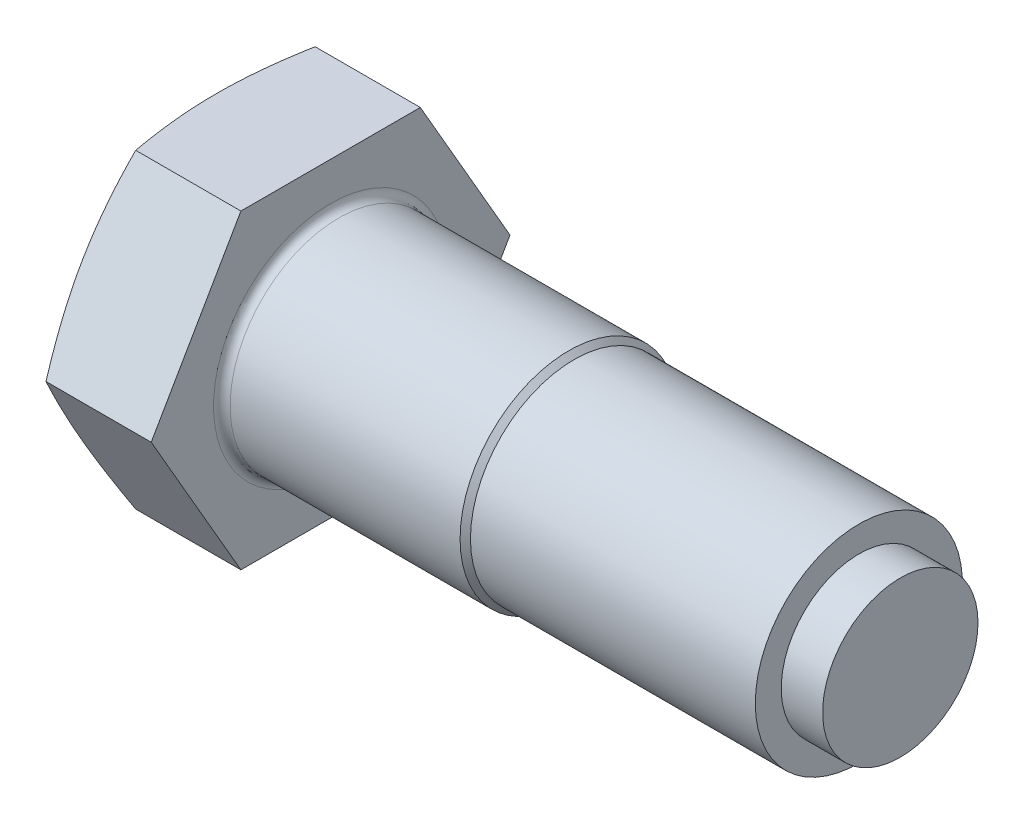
ISO-10303-21;
HEADER;
FILE_DESCRIPTION(('STEP AP214'),'2;1');
FILE_NAME('part.step','',(''),(''),'','','');
FILE_SCHEMA(('AUTOMOTIVE_DESIGN { 1 0 10303 214 1 1 1 1 }'));
ENDSEC;
DATA;
#1=APPLICATION_CONTEXT('core data for automotive mechanical design processes');
#2=APPLICATION_PROTOCOL_DEFINITION('international standard','automotive_design',2000,#1);
#3=PRODUCT_CONTEXT('',#1,'mechanical');
#4=PRODUCT('Part','Part','',(#3));
#5=PRODUCT_RELATED_PRODUCT_CATEGORY('part','',(#4));
#6=PRODUCT_DEFINITION_FORMATION('','',#4);
#7=PRODUCT_DEFINITION_CONTEXT('part definition',#1,'design');
#8=PRODUCT_DEFINITION('design','',#6,#7);
#9=PRODUCT_DEFINITION_SHAPE('','',#8);
#10=(LENGTH_UNIT() NAMED_UNIT(*) SI_UNIT(.MILLI.,.METRE.));
#11=(NAMED_UNIT(*) PLANE_ANGLE_UNIT() SI_UNIT($,.RADIAN.));
#12=(NAMED_UNIT(*) SI_UNIT($,.STERADIAN.) SOLID_ANGLE_UNIT());
#13=UNCERTAINTY_MEASURE_WITH_UNIT(LENGTH_MEASURE(1.E-05),#10,'distance_accuracy_value','');
#14=(GEOMETRIC_REPRESENTATION_CONTEXT(3) GLOBAL_UNCERTAINTY_ASSIGNED_CONTEXT((#13)) GLOBAL_UNIT_ASSIGNED_CONTEXT((#10,
#11,#12)) REPRESENTATION_CONTEXT('',''));
#15=CARTESIAN_POINT('',(0.,0.,0.));
#16=DIRECTION('',(0.,0.,1.));
#17=DIRECTION('',(1.,0.,0.));
#18=AXIS2_PLACEMENT_3D('',#15,#16,#17);
#19=CARTESIAN_POINT('',(11.,-15.,-8.66025403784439));
#20=DIRECTION('',(0.,0.5,0.866025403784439));
#21=DIRECTION('',(0.,-0.866025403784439,0.5));
#22=AXIS2_PLACEMENT_3D('',#19,#20,#21);
#23=PLANE('',#22);
#24=CARTESIAN_POINT('',(0.844637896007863,0.000200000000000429,-17.3206235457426));
#25=CARTESIAN_POINT('',(0.779364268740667,-0.310443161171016,-17.1412736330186));
#26=CARTESIAN_POINT('',(0.717026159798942,-0.621542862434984,-16.961660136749));
#27=CARTESIAN_POINT('',(0.598866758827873,-1.24469773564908,-16.6018815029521));
#28=CARTESIAN_POINT('',(0.543046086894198,-1.55675299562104,-16.4217163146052));
#29=CARTESIAN_POINT('',(0.386274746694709,-2.49475901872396,-15.8801582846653));
#30=CARTESIAN_POINT('',(0.296106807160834,-3.12212058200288,-15.5179509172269));
#31=CARTESIAN_POINT('',(0.186523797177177,-4.06237563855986,-14.9750944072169));
#32=CARTESIAN_POINT('',(0.154367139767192,-4.37418429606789,-14.7950715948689));
#33=CARTESIAN_POINT('',(0.0988350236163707,-4.99838379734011,-14.4346898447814));
#34=CARTESIAN_POINT('',(0.075459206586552,-5.31077461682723,-14.2543309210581));
#35=CARTESIAN_POINT('',(0.0378970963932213,-5.93586386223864,-13.8934354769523));
#36=CARTESIAN_POINT('',(0.0237076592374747,-6.24856214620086,-13.7128990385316));
#37=CARTESIAN_POINT('',(0.00475912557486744,-6.87417362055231,-13.3517020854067));
#38=CARTESIAN_POINT('',(0.,-7.18708681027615,-13.1710415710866));
#39=CARTESIAN_POINT('',(0.,-7.81291318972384,-12.8097205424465));
#40=CARTESIAN_POINT('',(0.00475912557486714,-8.12582637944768,-12.6290600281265));
#41=CARTESIAN_POINT('',(0.0237076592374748,-8.75143785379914,-12.2678630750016));
#42=CARTESIAN_POINT('',(0.0378970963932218,-9.06413613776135,-12.0873266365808));
#43=CARTESIAN_POINT('',(0.0754592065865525,-9.68922538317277,-11.726431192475));
#44=CARTESIAN_POINT('',(0.0988350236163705,-10.0016162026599,-11.5460722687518));
#45=CARTESIAN_POINT('',(0.154367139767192,-10.6258157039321,-11.1856905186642));
#46=CARTESIAN_POINT('',(0.186523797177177,-10.9376243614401,-11.0056677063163));
#47=CARTESIAN_POINT('',(0.296106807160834,-11.8778794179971,-10.4628111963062));
#48=CARTESIAN_POINT('',(0.386274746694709,-12.505240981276,-10.1006038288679));
#49=CARTESIAN_POINT('',(0.543046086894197,-13.443247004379,-9.55904579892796));
#50=CARTESIAN_POINT('',(0.598866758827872,-13.7553022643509,-9.37888061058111));
#51=CARTESIAN_POINT('',(0.71702615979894,-14.378457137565,-9.01910197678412));
#52=CARTESIAN_POINT('',(0.779364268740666,-14.689556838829,-8.83948848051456));
#53=CARTESIAN_POINT('',(0.844637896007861,-15.0002,-8.66013856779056));
#54=B_SPLINE_CURVE_WITH_KNOTS('',3,(#24,#25,#26,#27,#28,#29,#30,#31,#32,#33,#34,#35,#36,#37,#38,
#39,#40,#41,#42,#43,#44,#45,#46,#47,#48,#49,#50,#51,#52,#53),.UNSPECIFIED.,.F.,.F.,(4,2,2,2,2,2,
2,2,2,2,2,2,2,2,4),(0.,1.0937389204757,2.18758181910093,4.37677976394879,5.46113055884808,
6.54543710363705,7.62937235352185,8.71330426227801,9.79723617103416,10.881171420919,
11.9654779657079,13.0498287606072,15.2390267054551,16.3328696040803,17.426608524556),.UNSPECIFIED.);
#55=CARTESIAN_POINT('',(0.844595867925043,0.,-17.3205080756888));
#56=VERTEX_POINT('',#55);
#57=CARTESIAN_POINT('',(0.,-7.5,-12.9903810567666));
#58=VERTEX_POINT('',#57);
#59=EDGE_CURVE('E113',#56,#58,#54,.T.);
#60=ORIENTED_EDGE('',*,*,#59,.F.);
#61=DIRECTION('',(-1.,0.,0.));
#62=VECTOR('',#61,1.);
#63=CARTESIAN_POINT('',(11.,0.,-17.3205080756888));
#64=LINE('',#63,#62);
#65=CARTESIAN_POINT('',(11.,0.,-17.3205080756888));
#66=VERTEX_POINT('',#65);
#67=EDGE_CURVE('E142',#66,#56,#64,.T.);
#68=ORIENTED_EDGE('',*,*,#67,.F.);
#69=DIRECTION('',(0.,0.866025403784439,-0.5));
#70=VECTOR('',#69,1.);
#71=CARTESIAN_POINT('',(11.,-15.,-8.66025403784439));
#72=LINE('',#71,#70);
#73=CARTESIAN_POINT('',(11.,-15.,-8.66025403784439));
#74=VERTEX_POINT('',#73);
#75=EDGE_CURVE('E179',#74,#66,#72,.T.);
#76=ORIENTED_EDGE('',*,*,#75,.F.);
#77=DIRECTION('',(-1.,0.,0.));
#78=VECTOR('',#77,1.);
#79=CARTESIAN_POINT('',(11.,-15.,-8.66025403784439));
#80=LINE('',#79,#78);
#81=CARTESIAN_POINT('',(0.844595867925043,-15.,-8.66025403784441));
#82=VERTEX_POINT('',#81);
#83=EDGE_CURVE('E136',#74,#82,#80,.T.);
#84=ORIENTED_EDGE('',*,*,#83,.T.);
#85=EDGE_CURVE('E200',#58,#82,#54,.T.);
#86=ORIENTED_EDGE('',*,*,#85,.F.);
#87=EDGE_LOOP('',(#60,#68,#76,#84,#86));
#88=FACE_BOUND('',#87,.T.);
#89=ADVANCED_FACE('F35',(#88),#23,.F.);
#90=CARTESIAN_POINT('',(11.,0.,-17.3205080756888));
#91=DIRECTION('',(0.,-0.5,0.866025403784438));
#92=DIRECTION('',(0.,-0.866025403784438,-0.5));
#93=AXIS2_PLACEMENT_3D('',#90,#91,#92);
#94=PLANE('',#93);
#95=CARTESIAN_POINT('',(0.844637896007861,15.0002,-8.66013856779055));
#96=CARTESIAN_POINT('',(0.779364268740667,14.689556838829,-8.83948848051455));
#97=CARTESIAN_POINT('',(0.717026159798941,14.378457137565,-9.01910197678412));
#98=CARTESIAN_POINT('',(0.598866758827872,13.7553022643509,-9.37888061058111));
#99=CARTESIAN_POINT('',(0.543046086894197,13.443247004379,-9.55904579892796));
#100=CARTESIAN_POINT('',(0.386274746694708,12.505240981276,-10.1006038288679));
#101=CARTESIAN_POINT('',(0.296106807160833,11.8778794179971,-10.4628111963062));
#102=CARTESIAN_POINT('',(0.186523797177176,10.9376243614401,-11.0056677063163));
#103=CARTESIAN_POINT('',(0.154367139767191,10.6258157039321,-11.1856905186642));
#104=CARTESIAN_POINT('',(0.0988350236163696,10.0016162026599,-11.5460722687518));
#105=CARTESIAN_POINT('',(0.0754592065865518,9.68922538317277,-11.726431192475));
#106=CARTESIAN_POINT('',(0.0378970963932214,9.06413613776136,-12.0873266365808));
#107=CARTESIAN_POINT('',(0.0237076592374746,8.75143785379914,-12.2678630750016));
#108=CARTESIAN_POINT('',(0.00475912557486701,8.12582637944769,-12.6290600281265));
#109=CARTESIAN_POINT('',(0.,7.81291318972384,-12.8097205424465));
#110=CARTESIAN_POINT('',(0.,7.18708681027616,-13.1710415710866));
#111=CARTESIAN_POINT('',(0.00475912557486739,6.87417362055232,-13.3517020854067));
#112=CARTESIAN_POINT('',(0.0237076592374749,6.24856214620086,-13.7128990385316));
#113=CARTESIAN_POINT('',(0.0378970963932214,5.93586386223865,-13.8934354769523));
#114=CARTESIAN_POINT('',(0.0754592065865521,5.31077461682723,-14.2543309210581));
#115=CARTESIAN_POINT('',(0.0988350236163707,4.99838379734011,-14.4346898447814));
#116=CARTESIAN_POINT('',(0.154367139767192,4.37418429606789,-14.7950715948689));
#117=CARTESIAN_POINT('',(0.186523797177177,4.06237563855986,-14.9750944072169));
#118=CARTESIAN_POINT('',(0.296106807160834,3.12212058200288,-15.5179509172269));
#119=CARTESIAN_POINT('',(0.386274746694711,2.49475901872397,-15.8801582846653));
#120=CARTESIAN_POINT('',(0.543046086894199,1.55675299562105,-16.4217163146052));
#121=CARTESIAN_POINT('',(0.598866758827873,1.24469773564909,-16.6018815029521));
#122=CARTESIAN_POINT('',(0.717026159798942,0.621542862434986,-16.961660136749));
#123=CARTESIAN_POINT('',(0.779364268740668,0.310443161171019,-17.1412736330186));
#124=CARTESIAN_POINT('',(0.844637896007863,-0.000199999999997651,-17.3206235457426));
#125=B_SPLINE_CURVE_WITH_KNOTS('',3,(#95,#96,#97,#98,#99,#100,#101,#102,#103,#104,#105,#106,
#107,#108,#109,#110,#111,#112,#113,#114,#115,#116,#117,#118,#119,#120,#121,#122,#123,#124),
.UNSPECIFIED.,.F.,.F.,(4,2,2,2,2,2,2,2,2,2,2,2,2,2,4),(0.,1.0937389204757,2.18758181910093,
4.37677976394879,5.46113055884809,6.54543710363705,7.62937235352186,8.71330426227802,
9.79723617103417,10.881171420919,11.9654779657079,13.0498287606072,15.2390267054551,
16.3328696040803,17.426608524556),.UNSPECIFIED.);
#126=CARTESIAN_POINT('',(0.844595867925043,15.,-8.6602540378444));
#127=VERTEX_POINT('',#126);
#128=CARTESIAN_POINT('',(0.,7.50000000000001,-12.9903810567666));
#129=VERTEX_POINT('',#128);
#130=EDGE_CURVE('E252',#127,#129,#125,.T.);
#131=ORIENTED_EDGE('',*,*,#130,.F.);
#132=DIRECTION('',(-1.,0.,0.));
#133=VECTOR('',#132,1.);
#134=CARTESIAN_POINT('',(11.,15.,-8.66025403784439));
#135=LINE('',#134,#133);
#136=CARTESIAN_POINT('',(11.,15.,-8.66025403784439));
#137=VERTEX_POINT('',#136);
#138=EDGE_CURVE('E133',#137,#127,#135,.T.);
#139=ORIENTED_EDGE('',*,*,#138,.F.);
#140=DIRECTION('',(0.,0.866025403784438,0.5));
#141=VECTOR('',#140,1.);
#142=CARTESIAN_POINT('',(11.,0.,-17.3205080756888));
#143=LINE('',#142,#141);
#144=EDGE_CURVE('E182',#66,#137,#143,.T.);
#145=ORIENTED_EDGE('',*,*,#144,.F.);
#146=ORIENTED_EDGE('',*,*,#67,.T.);
#147=EDGE_CURVE('E125',#129,#56,#125,.T.);
#148=ORIENTED_EDGE('',*,*,#147,.F.);
#149=EDGE_LOOP('',(#131,#139,#145,#146,#148));
#150=FACE_BOUND('',#149,.T.);
#151=ADVANCED_FACE('F258',(#150),#94,.F.);
#152=CARTESIAN_POINT('',(11.,15.,-8.66025403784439));
#153=DIRECTION('',(0.,-1.,0.));
#154=DIRECTION('',(0.,0.,-1.));
#155=AXIS2_PLACEMENT_3D('',#152,#153,#154);
#156=PLANE('',#155);
#157=CARTESIAN_POINT('',(4.5131853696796,15.,-22.9293075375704));
#158=CARTESIAN_POINT('',(4.40983513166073,15.,-22.5899853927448));
#159=CARTESIAN_POINT('',(4.30710990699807,15.,-22.2504729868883));
#160=CARTESIAN_POINT('',(4.10304940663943,15.,-21.5710286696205));
#161=CARTESIAN_POINT('',(4.0017141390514,15.,-21.2310967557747));
#162=CARTESIAN_POINT('',(3.69999008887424,15.,-20.2105689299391));
#163=CARTESIAN_POINT('',(3.50189837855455,15.,-19.5292910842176));
#164=CARTESIAN_POINT('',(3.11288892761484,15.,-18.163310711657));
#165=CARTESIAN_POINT('',(2.92198526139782,15.,-17.4786041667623));
#166=CARTESIAN_POINT('',(2.54957050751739,15.,-16.1066443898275));
#167=CARTESIAN_POINT('',(2.36805925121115,15.,-15.4193912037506));
#168=CARTESIAN_POINT('',(2.0189263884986,15.,-14.0503721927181));
#169=CARTESIAN_POINT('',(1.851161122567,15.,-13.368643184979));
#170=CARTESIAN_POINT('',(1.52991356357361,15.,-12.0017928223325));
#171=CARTESIAN_POINT('',(1.37643151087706,15.,-11.3166714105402));
#172=CARTESIAN_POINT('',(1.08732897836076,15.,-9.94288290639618));
#173=CARTESIAN_POINT('',(0.951702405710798,15.,-9.25421710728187));
#174=CARTESIAN_POINT('',(0.702440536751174,15.,-7.8728873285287));
#175=CARTESIAN_POINT('',(0.588804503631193,15.,-7.18022348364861));
#176=CARTESIAN_POINT('',(0.399391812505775,15.,-5.86889428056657));
#177=CARTESIAN_POINT('',(0.32079887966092,15.,-5.25063953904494));
#178=CARTESIAN_POINT('',(0.187759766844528,15.,-4.01151576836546));
#179=CARTESIAN_POINT('',(0.133312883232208,15.,-3.39064681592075));
#180=CARTESIAN_POINT('',(0.0511879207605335,15.,-2.14755397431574));
#181=CARTESIAN_POINT('',(0.0234909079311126,15.,-1.52533135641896));
#182=CARTESIAN_POINT('',(-0.00373201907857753,15.,-0.280263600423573));
#183=CARTESIAN_POINT('',(-0.00325813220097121,15.,0.342581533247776));
#184=CARTESIAN_POINT('',(0.02590876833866,15.,1.59076022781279));
#185=CARTESIAN_POINT('',(0.0547448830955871,15.,2.21609038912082));
#186=CARTESIAN_POINT('',(0.139309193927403,15.,3.46491396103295));
#187=CARTESIAN_POINT('',(0.195038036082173,15.,4.08840732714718));
#188=CARTESIAN_POINT('',(0.330780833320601,15.,5.33324943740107));
#189=CARTESIAN_POINT('',(0.41081564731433,15.,5.9545958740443));
#190=CARTESIAN_POINT('',(0.591923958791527,15.,7.19418030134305));
#191=CARTESIAN_POINT('',(0.692997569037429,15.,7.81241827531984));
#192=CARTESIAN_POINT('',(0.918710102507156,15.,9.07831857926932));
#193=CARTESIAN_POINT('',(1.04431272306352,15.,9.72580754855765));
#194=CARTESIAN_POINT('',(1.3116837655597,15.,11.0174604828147));
#195=CARTESIAN_POINT('',(1.45345340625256,15.,11.6616241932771));
#196=CARTESIAN_POINT('',(1.75018161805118,15.,12.9470856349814));
#197=CARTESIAN_POINT('',(1.90514401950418,15.,13.5883824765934));
#198=CARTESIAN_POINT('',(2.22573697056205,15.,14.8682746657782));
#199=CARTESIAN_POINT('',(2.39136726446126,15.,15.5068700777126));
#200=CARTESIAN_POINT('',(2.73152020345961,15.,16.7825582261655));
#201=CARTESIAN_POINT('',(2.90605399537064,15.,17.419647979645));
#202=CARTESIAN_POINT('',(3.26222144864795,15.,18.6918370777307));
#203=CARTESIAN_POINT('',(3.4438551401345,15.,19.3269364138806));
#204=CARTESIAN_POINT('',(3.81292279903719,15.,20.5953282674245));
#205=CARTESIAN_POINT('',(4.00035578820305,15.,21.2286210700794));
#206=CARTESIAN_POINT('',(4.38004374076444,15.,22.4937555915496));
#207=CARTESIAN_POINT('',(4.57229869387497,15.,23.1255973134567));
#208=CARTESIAN_POINT('',(4.95868121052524,15.,24.3810727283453));
#209=CARTESIAN_POINT('',(5.1527646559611,15.,25.0047200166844));
#210=CARTESIAN_POINT('',(5.54424157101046,15.,26.2509755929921));
#211=CARTESIAN_POINT('',(5.74163505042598,15.,26.8735838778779));
#212=CARTESIAN_POINT('',(6.33801421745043,15.,28.74012618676));
#213=CARTESIAN_POINT('',(6.74118201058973,15.,29.9827239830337));
#214=CARTESIAN_POINT('',(7.55410304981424,15.,32.4605337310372));
#215=CARTESIAN_POINT('',(7.96382550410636,15.,33.6957558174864));
#216=CARTESIAN_POINT('',(8.58295834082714,15.,35.5470094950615));
#217=CARTESIAN_POINT('',(8.79008571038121,15.,36.1638059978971));
#218=CARTESIAN_POINT('',(9.20568070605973,15.,37.3969457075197));
#219=CARTESIAN_POINT('',(9.41414832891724,15.,38.0132889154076));
#220=CARTESIAN_POINT('',(9.62319587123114,15.,38.6294352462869));
#221=B_SPLINE_CURVE_WITH_KNOTS('',3,(#157,#158,#159,#160,#161,#162,#163,#164,#165,#166,#167,
#168,#169,#170,#171,#172,#173,#174,#175,#176,#177,#178,#179,#180,#181,#182,#183,#184,#185,#186,
#187,#188,#189,#190,#191,#192,#193,#194,#195,#196,#197,#198,#199,#200,#201,#202,#203,#204,#205,
#206,#207,#208,#209,#210,#211,#212,#213,#214,#215,#216,#217,#218,#219,#220),.UNSPECIFIED.,.F.,
.F.,(4,2,2,2,2,2,2,2,2,2,2,2,2,2,2,2,2,2,2,2,2,2,2,2,2,2,2,2,2,2,2,4),(0.,1.06413565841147,
2.12827752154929,4.25671855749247,6.38913073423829,8.52150460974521,10.6275874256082,
12.7337056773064,14.8391033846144,16.9444305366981,18.81371040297,20.6829357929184,
22.5508371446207,24.4187253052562,26.2960864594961,28.1734927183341,30.052514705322,
31.9315467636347,33.9099705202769,35.888543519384,37.8676929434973,39.8467949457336,
41.8284386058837,43.8100906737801,45.7914102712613,47.7727256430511,49.732163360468,
51.6916068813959,55.6106625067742,59.5148479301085,61.4667833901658,63.4187140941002),.UNSPECIFIED.);
#222=CARTESIAN_POINT('',(0.844595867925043,15.,8.66025403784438));
#223=VERTEX_POINT('',#222);
#224=CARTESIAN_POINT('',(0.,15.,0.));
#225=VERTEX_POINT('',#224);
#226=EDGE_CURVE('E50',#223,#225,#221,.F.);
#227=ORIENTED_EDGE('',*,*,#226,.F.);
#228=DIRECTION('',(-1.,0.,0.));
#229=VECTOR('',#228,1.);
#230=CARTESIAN_POINT('',(11.,15.,8.66025403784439));
#231=LINE('',#230,#229);
#232=CARTESIAN_POINT('',(11.,15.,8.66025403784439));
#233=VERTEX_POINT('',#232);
#234=EDGE_CURVE('E130',#233,#223,#231,.T.);
#235=ORIENTED_EDGE('',*,*,#234,.F.);
#236=DIRECTION('',(0.,0.,1.));
#237=VECTOR('',#236,1.);
#238=CARTESIAN_POINT('',(11.,15.,-8.66025403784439));
#239=LINE('',#238,#237);
#240=EDGE_CURVE('E188',#137,#233,#239,.T.);
#241=ORIENTED_EDGE('',*,*,#240,.F.);
#242=ORIENTED_EDGE('',*,*,#138,.T.);
#243=EDGE_CURVE('E253',#225,#127,#221,.F.);
#244=ORIENTED_EDGE('',*,*,#243,.F.);
#245=EDGE_LOOP('',(#227,#235,#241,#242,#244));
#246=FACE_BOUND('',#245,.T.);
#247=ADVANCED_FACE('F261',(#246),#156,.F.);
#248=CARTESIAN_POINT('',(11.,15.,8.66025403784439));
#249=DIRECTION('',(0.,-0.5,-0.866025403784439));
#250=DIRECTION('',(0.,0.866025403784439,-0.5));
#251=AXIS2_PLACEMENT_3D('',#248,#249,#250);
#252=PLANE('',#251);
#253=CARTESIAN_POINT('',(0.844637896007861,-0.000199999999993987,17.3206235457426));
#254=CARTESIAN_POINT('',(0.779364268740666,0.310443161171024,17.1412736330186));
#255=CARTESIAN_POINT('',(0.71702615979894,0.621542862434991,16.961660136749));
#256=CARTESIAN_POINT('',(0.598866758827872,1.24469773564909,16.6018815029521));
#257=CARTESIAN_POINT('',(0.543046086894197,1.55675299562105,16.4217163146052));
#258=CARTESIAN_POINT('',(0.386274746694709,2.49475901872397,15.8801582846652));
#259=CARTESIAN_POINT('',(0.296106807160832,3.12212058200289,15.5179509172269));
#260=CARTESIAN_POINT('',(0.186523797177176,4.06237563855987,14.9750944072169));
#261=CARTESIAN_POINT('',(0.154367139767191,4.3741842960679,14.7950715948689));
#262=CARTESIAN_POINT('',(0.0988350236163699,4.99838379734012,14.4346898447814));
#263=CARTESIAN_POINT('',(0.0754592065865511,5.31077461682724,14.2543309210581));
#264=CARTESIAN_POINT('',(0.0378970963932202,5.93586386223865,13.8934354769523));
#265=CARTESIAN_POINT('',(0.0237076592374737,6.24856214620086,13.7128990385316));
#266=CARTESIAN_POINT('',(0.00475912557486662,6.87417362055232,13.3517020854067));
#267=CARTESIAN_POINT('',(0.,7.18708681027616,13.1710415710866));
#268=CARTESIAN_POINT('',(0.,7.81291318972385,12.8097205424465));
#269=CARTESIAN_POINT('',(0.00475912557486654,8.12582637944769,12.6290600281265));
#270=CARTESIAN_POINT('',(0.0237076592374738,8.75143785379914,12.2678630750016));
#271=CARTESIAN_POINT('',(0.0378970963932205,9.06413613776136,12.0873266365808));
#272=CARTESIAN_POINT('',(0.0754592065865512,9.68922538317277,11.726431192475));
#273=CARTESIAN_POINT('',(0.0988350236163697,10.0016162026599,11.5460722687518));
#274=CARTESIAN_POINT('',(0.154367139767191,10.6258157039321,11.1856905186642));
#275=CARTESIAN_POINT('',(0.186523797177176,10.9376243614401,11.0056677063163));
#276=CARTESIAN_POINT('',(0.296106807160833,11.8778794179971,10.4628111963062));
#277=CARTESIAN_POINT('',(0.386274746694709,12.505240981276,10.1006038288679));
#278=CARTESIAN_POINT('',(0.543046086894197,13.443247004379,9.55904579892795));
#279=CARTESIAN_POINT('',(0.598866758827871,13.7553022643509,9.3788806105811));
#280=CARTESIAN_POINT('',(0.71702615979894,14.378457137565,9.01910197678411));
#281=CARTESIAN_POINT('',(0.779364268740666,14.689556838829,8.83948848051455));
#282=CARTESIAN_POINT('',(0.844637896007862,15.0002,8.66013856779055));
#283=B_SPLINE_CURVE_WITH_KNOTS('',3,(#253,#254,#255,#256,#257,#258,#259,#260,#261,#262,#263,
#264,#265,#266,#267,#268,#269,#270,#271,#272,#273,#274,#275,#276,#277,#278,#279,#280,#281,#282),
.UNSPECIFIED.,.F.,.F.,(4,2,2,2,2,2,2,2,2,2,2,2,2,2,4),(0.,1.0937389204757,2.18758181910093,
4.37677976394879,5.46113055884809,6.54543710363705,7.62937235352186,8.71330426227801,
9.79723617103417,10.881171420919,11.9654779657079,13.0498287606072,15.2390267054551,
16.3328696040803,17.426608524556),.UNSPECIFIED.);
#284=CARTESIAN_POINT('',(0.844595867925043,0.,17.3205080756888));
#285=VERTEX_POINT('',#284);
#286=CARTESIAN_POINT('',(0.,7.5,12.9903810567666));
#287=VERTEX_POINT('',#286);
#288=EDGE_CURVE('E58',#285,#287,#283,.T.);
#289=ORIENTED_EDGE('',*,*,#288,.F.);
#290=DIRECTION('',(-1.,0.,0.));
#291=VECTOR('',#290,1.);
#292=CARTESIAN_POINT('',(11.,0.,17.3205080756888));
#293=LINE('',#292,#291);
#294=CARTESIAN_POINT('',(11.,0.,17.3205080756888));
#295=VERTEX_POINT('',#294);
#296=EDGE_CURVE('E121',#295,#285,#293,.T.);
#297=ORIENTED_EDGE('',*,*,#296,.F.);
#298=DIRECTION('',(0.,-0.866025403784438,0.5));
#299=VECTOR('',#298,1.);
#300=CARTESIAN_POINT('',(11.,15.,8.66025403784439));
#301=LINE('',#300,#299);
#302=EDGE_CURVE('E190',#233,#295,#301,.T.);
#303=ORIENTED_EDGE('',*,*,#302,.F.);
#304=ORIENTED_EDGE('',*,*,#234,.T.);
#305=EDGE_CURVE('E124',#287,#223,#283,.T.);
#306=ORIENTED_EDGE('',*,*,#305,.F.);
#307=EDGE_LOOP('',(#289,#297,#303,#304,#306));
#308=FACE_BOUND('',#307,.T.);
#309=ADVANCED_FACE('F119',(#308),#252,.F.);
#310=CARTESIAN_POINT('',(11.,0.,17.3205080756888));
#311=DIRECTION('',(0.,0.5,-0.866025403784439));
#312=DIRECTION('',(0.,0.866025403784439,0.5));
#313=AXIS2_PLACEMENT_3D('',#310,#311,#312);
#314=PLANE('',#313);
#315=CARTESIAN_POINT('',(0.844637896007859,-15.0002,8.66013856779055));
#316=CARTESIAN_POINT('',(0.779364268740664,-14.689556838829,8.83948848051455));
#317=CARTESIAN_POINT('',(0.717026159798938,-14.378457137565,9.01910197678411));
#318=CARTESIAN_POINT('',(0.59886675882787,-13.7553022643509,9.3788806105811));
#319=CARTESIAN_POINT('',(0.543046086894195,-13.4432470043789,9.55904579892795));
#320=CARTESIAN_POINT('',(0.386274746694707,-12.505240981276,10.1006038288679));
#321=CARTESIAN_POINT('',(0.296106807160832,-11.8778794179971,10.4628111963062));
#322=CARTESIAN_POINT('',(0.186523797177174,-10.9376243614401,11.0056677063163));
#323=CARTESIAN_POINT('',(0.154367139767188,-10.6258157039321,11.1856905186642));
#324=CARTESIAN_POINT('',(0.098835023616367,-10.0016162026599,11.5460722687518));
#325=CARTESIAN_POINT('',(0.075459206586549,-9.68922538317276,11.726431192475));
#326=CARTESIAN_POINT('',(0.0378970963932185,-9.06413613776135,12.0873266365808));
#327=CARTESIAN_POINT('',(0.0237076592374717,-8.75143785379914,12.2678630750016));
#328=CARTESIAN_POINT('',(0.00475912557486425,-8.12582637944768,12.6290600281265));
#329=CARTESIAN_POINT('',(0.,-7.81291318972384,12.8097205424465));
#330=CARTESIAN_POINT('',(0.,-7.18708681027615,13.1710415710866));
#331=CARTESIAN_POINT('',(0.00475912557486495,-6.87417362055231,13.3517020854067));
#332=CARTESIAN_POINT('',(0.0237076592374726,-6.24856214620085,13.7128990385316));
#333=CARTESIAN_POINT('',(0.0378970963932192,-5.93586386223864,13.8934354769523));
#334=CARTESIAN_POINT('',(0.0754592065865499,-5.31077461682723,14.2543309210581));
#335=CARTESIAN_POINT('',(0.0988350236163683,-4.99838379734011,14.4346898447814));
#336=CARTESIAN_POINT('',(0.154367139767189,-4.37418429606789,14.7950715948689));
#337=CARTESIAN_POINT('',(0.186523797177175,-4.06237563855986,14.9750944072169));
#338=CARTESIAN_POINT('',(0.296106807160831,-3.12212058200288,15.5179509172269));
#339=CARTESIAN_POINT('',(0.386274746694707,-2.49475901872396,15.8801582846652));
#340=CARTESIAN_POINT('',(0.543046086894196,-1.55675299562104,16.4217163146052));
#341=CARTESIAN_POINT('',(0.598866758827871,-1.24469773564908,16.6018815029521));
#342=CARTESIAN_POINT('',(0.71702615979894,-0.62154286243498,16.961660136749));
#343=CARTESIAN_POINT('',(0.779364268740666,-0.310443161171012,17.1412736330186));
#344=CARTESIAN_POINT('',(0.844637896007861,0.000200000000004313,17.3206235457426));
#345=B_SPLINE_CURVE_WITH_KNOTS('',3,(#315,#316,#317,#318,#319,#320,#321,#322,#323,#324,#325,
#326,#327,#328,#329,#330,#331,#332,#333,#334,#335,#336,#337,#338,#339,#340,#341,#342,#343,#344),
.UNSPECIFIED.,.F.,.F.,(4,2,2,2,2,2,2,2,2,2,2,2,2,2,4),(0.,1.0937389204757,2.18758181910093,
4.37677976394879,5.46113055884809,6.54543710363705,7.62937235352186,8.71330426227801,
9.79723617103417,10.881171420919,11.9654779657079,13.0498287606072,15.2390267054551,
16.3328696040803,17.426608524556),.UNSPECIFIED.);
#346=CARTESIAN_POINT('',(0.844595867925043,-15.,8.66025403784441));
#347=VERTEX_POINT('',#346);
#348=CARTESIAN_POINT('',(0.,-7.5,12.9903810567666));
#349=VERTEX_POINT('',#348);
#350=EDGE_CURVE('E115',#347,#349,#345,.T.);
#351=ORIENTED_EDGE('',*,*,#350,.F.);
#352=DIRECTION('',(-1.,0.,0.));
#353=VECTOR('',#352,1.);
#354=CARTESIAN_POINT('',(11.,-15.,8.66025403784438));
#355=LINE('',#354,#353);
#356=CARTESIAN_POINT('',(11.,-15.,8.66025403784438));
#357=VERTEX_POINT('',#356);
#358=EDGE_CURVE('E131',#357,#347,#355,.T.);
#359=ORIENTED_EDGE('',*,*,#358,.F.);
#360=DIRECTION('',(0.,-0.866025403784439,-0.5));
#361=VECTOR('',#360,1.);
#362=CARTESIAN_POINT('',(11.,0.,17.3205080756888));
#363=LINE('',#362,#361);
#364=EDGE_CURVE('E129',#295,#357,#363,.T.);
#365=ORIENTED_EDGE('',*,*,#364,.F.);
#366=ORIENTED_EDGE('',*,*,#296,.T.);
#367=EDGE_CURVE('E105',#349,#285,#345,.T.);
#368=ORIENTED_EDGE('',*,*,#367,.F.);
#369=EDGE_LOOP('',(#351,#359,#365,#366,#368));
#370=FACE_BOUND('',#369,.T.);
#371=ADVANCED_FACE('F127',(#370),#314,.F.);
#372=CARTESIAN_POINT('',(11.,-15.,8.66025403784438));
#373=DIRECTION('',(0.,1.,0.));
#374=DIRECTION('',(0.,0.,1.));
#375=AXIS2_PLACEMENT_3D('',#372,#373,#374);
#376=PLANE('',#375);
#377=CARTESIAN_POINT('',(4.5131853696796,-15.,-22.9293075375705));
#378=CARTESIAN_POINT('',(4.40983513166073,-15.,-22.5899853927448));
#379=CARTESIAN_POINT('',(4.30710990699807,-15.,-22.2504729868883));
#380=CARTESIAN_POINT('',(4.10304940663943,-15.,-21.5710286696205));
#381=CARTESIAN_POINT('',(4.0017141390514,-15.,-21.2310967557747));
#382=CARTESIAN_POINT('',(3.69999008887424,-15.,-20.2105689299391));
#383=CARTESIAN_POINT('',(3.50189837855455,-15.,-19.5292910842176));
#384=CARTESIAN_POINT('',(3.11288892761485,-15.,-18.163310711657));
#385=CARTESIAN_POINT('',(2.92198526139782,-15.,-17.4786041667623));
#386=CARTESIAN_POINT('',(2.5495705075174,-15.,-16.1066443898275));
#387=CARTESIAN_POINT('',(2.36805925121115,-15.,-15.4193912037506));
#388=CARTESIAN_POINT('',(2.01892638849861,-15.,-14.0503721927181));
#389=CARTESIAN_POINT('',(1.851161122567,-15.,-13.368643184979));
#390=CARTESIAN_POINT('',(1.5299135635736,-15.,-12.0017928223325));
#391=CARTESIAN_POINT('',(1.37643151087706,-15.,-11.3166714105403));
#392=CARTESIAN_POINT('',(1.08732897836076,-15.,-9.94288290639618));
#393=CARTESIAN_POINT('',(0.951702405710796,-15.,-9.25421710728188));
#394=CARTESIAN_POINT('',(0.702440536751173,-15.,-7.87288732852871));
#395=CARTESIAN_POINT('',(0.588804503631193,-15.,-7.18022348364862));
#396=CARTESIAN_POINT('',(0.399391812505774,-15.,-5.86889428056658));
#397=CARTESIAN_POINT('',(0.320798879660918,-15.,-5.25063953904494));
#398=CARTESIAN_POINT('',(0.187759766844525,-15.,-4.01151576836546));
#399=CARTESIAN_POINT('',(0.133312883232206,-15.,-3.39064681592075));
#400=CARTESIAN_POINT('',(0.0511879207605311,-15.,-2.14755397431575));
#401=CARTESIAN_POINT('',(0.0234909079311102,-15.,-1.52533135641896));
#402=CARTESIAN_POINT('',(-0.00373201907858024,-15.,-0.280263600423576));
#403=CARTESIAN_POINT('',(-0.00325813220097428,-15.,0.342581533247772));
#404=CARTESIAN_POINT('',(0.0259087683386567,-15.,1.59076022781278));
#405=CARTESIAN_POINT('',(0.0547448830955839,-15.,2.21609038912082));
#406=CARTESIAN_POINT('',(0.1393091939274,-15.,3.46491396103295));
#407=CARTESIAN_POINT('',(0.19503803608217,-15.,4.08840732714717));
#408=CARTESIAN_POINT('',(0.330780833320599,-15.,5.33324943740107));
#409=CARTESIAN_POINT('',(0.410815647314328,-15.,5.95459587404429));
#410=CARTESIAN_POINT('',(0.591923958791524,-15.,7.19418030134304));
#411=CARTESIAN_POINT('',(0.692997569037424,-15.,7.81241827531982));
#412=CARTESIAN_POINT('',(0.91871010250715,-15.,9.0783185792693));
#413=CARTESIAN_POINT('',(1.04431272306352,-15.,9.72580754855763));
#414=CARTESIAN_POINT('',(1.31168376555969,-15.,11.0174604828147));
#415=CARTESIAN_POINT('',(1.45345340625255,-15.,11.6616241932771));
#416=CARTESIAN_POINT('',(1.75018161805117,-15.,12.9470856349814));
#417=CARTESIAN_POINT('',(1.90514401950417,-15.,13.5883824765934));
#418=CARTESIAN_POINT('',(2.22573697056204,-15.,14.8682746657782));
#419=CARTESIAN_POINT('',(2.39136726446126,-15.,15.5068700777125));
#420=CARTESIAN_POINT('',(2.7315202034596,-15.,16.7825582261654));
#421=CARTESIAN_POINT('',(2.90605399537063,-15.,17.4196479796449));
#422=CARTESIAN_POINT('',(3.26222144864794,-15.,18.6918370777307));
#423=CARTESIAN_POINT('',(3.44385514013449,-15.,19.3269364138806));
#424=CARTESIAN_POINT('',(3.81292279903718,-15.,20.5953282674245));
#425=CARTESIAN_POINT('',(4.00035578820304,-15.,21.2286210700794));
#426=CARTESIAN_POINT('',(4.38004374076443,-15.,22.4937555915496));
#427=CARTESIAN_POINT('',(4.57229869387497,-15.,23.1255973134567));
#428=CARTESIAN_POINT('',(4.95868121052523,-15.,24.3810727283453));
#429=CARTESIAN_POINT('',(5.15276465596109,-15.,25.0047200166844));
#430=CARTESIAN_POINT('',(5.54424157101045,-15.,26.2509755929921));
#431=CARTESIAN_POINT('',(5.74163505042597,-15.,26.8735838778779));
#432=CARTESIAN_POINT('',(6.33801421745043,-15.,28.74012618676));
#433=CARTESIAN_POINT('',(6.74118201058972,-15.,29.9827239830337));
#434=CARTESIAN_POINT('',(7.55410304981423,-15.,32.4605337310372));
#435=CARTESIAN_POINT('',(7.96382550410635,-15.,33.6957558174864));
#436=CARTESIAN_POINT('',(8.58295834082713,-15.,35.5470094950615));
#437=CARTESIAN_POINT('',(8.79008571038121,-15.,36.1638059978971));
#438=CARTESIAN_POINT('',(9.20568070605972,-15.,37.3969457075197));
#439=CARTESIAN_POINT('',(9.41414832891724,-15.,38.0132889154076));
#440=CARTESIAN_POINT('',(9.62319587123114,-15.,38.6294352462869));
#441=B_SPLINE_CURVE_WITH_KNOTS('',3,(#377,#378,#379,#380,#381,#382,#383,#384,#385,#386,#387,
#388,#389,#390,#391,#392,#393,#394,#395,#396,#397,#398,#399,#400,#401,#402,#403,#404,#405,#406,
#407,#408,#409,#410,#411,#412,#413,#414,#415,#416,#417,#418,#419,#420,#421,#422,#423,#424,#425,
#426,#427,#428,#429,#430,#431,#432,#433,#434,#435,#436,#437,#438,#439,#440),.UNSPECIFIED.,.F.,
.F.,(4,2,2,2,2,2,2,2,2,2,2,2,2,2,2,2,2,2,2,2,2,2,2,2,2,2,2,2,2,2,2,4),(0.,1.06413565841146,
2.12827752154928,4.25671855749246,6.38913073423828,8.5215046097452,10.6275874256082,
12.7337056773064,14.8391033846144,16.9444305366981,18.81371040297,20.6829357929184,
22.5508371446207,24.4187253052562,26.2960864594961,28.1734927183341,30.052514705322,
31.9315467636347,33.9099705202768,35.8885435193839,37.8676929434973,39.8467949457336,
41.8284386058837,43.8100906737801,45.7914102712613,47.7727256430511,49.732163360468,
51.6916068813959,55.6106625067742,59.5148479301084,61.4667833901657,63.4187140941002),.UNSPECIFIED.);
#442=CARTESIAN_POINT('',(0.,-15.,0.));
#443=VERTEX_POINT('',#442);
#444=EDGE_CURVE('E208',#82,#443,#441,.T.);
#445=ORIENTED_EDGE('',*,*,#444,.F.);
#446=ORIENTED_EDGE('',*,*,#83,.F.);
#447=DIRECTION('',(0.,0.,-1.));
#448=VECTOR('',#447,1.);
#449=CARTESIAN_POINT('',(11.,-15.,8.66025403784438));
#450=LINE('',#449,#448);
#451=EDGE_CURVE('E193',#357,#74,#450,.T.);
#452=ORIENTED_EDGE('',*,*,#451,.F.);
#453=ORIENTED_EDGE('',*,*,#358,.T.);
#454=EDGE_CURVE('E209',#443,#347,#441,.T.);
#455=ORIENTED_EDGE('',*,*,#454,.F.);
#456=EDGE_LOOP('',(#445,#446,#452,#453,#455));
#457=FACE_BOUND('',#456,.T.);
#458=ADVANCED_FACE('F205',(#457),#376,.F.);
#459=CARTESIAN_POINT('',(149.284271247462,0.,0.));
#460=DIRECTION('',(-1.,0.,0.));
#461=DIRECTION('',(0.,0.,1.));
#462=AXIS2_PLACEMENT_3D('',#459,#460,#461);
#463=CYLINDRICAL_SURFACE('',#462,10.);
#464=CARTESIAN_POINT('',(34.5000000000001,0.,0.));
#465=DIRECTION('',(1.,0.,0.));
#466=DIRECTION('',(0.,0.,-1.));
#467=AXIS2_PLACEMENT_3D('',#464,#465,#466);
#468=CIRCLE('',#467,10.);
#469=CARTESIAN_POINT('',(34.5000000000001,0.,10.));
#470=VERTEX_POINT('',#469);
#471=EDGE_CURVE('E13',#470,#470,#468,.T.);
#472=CARTESIAN_POINT('',(62.,0.,0.));
#473=DIRECTION('',(1.,0.,0.));
#474=DIRECTION('',(0.,0.,-1.));
#475=AXIS2_PLACEMENT_3D('',#472,#473,#474);
#476=CIRCLE('',#475,10.);
#477=CARTESIAN_POINT('',(62.,0.,10.));
#478=VERTEX_POINT('',#477);
#479=EDGE_CURVE('E146',#478,#478,#476,.T.);
#480=CARTESIAN_POINT('',(34.5000000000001,0.,10.));
#481=CARTESIAN_POINT('',(34.7864583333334,0.,10.));
#482=CARTESIAN_POINT('',(35.0729166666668,0.,10.));
#483=CARTESIAN_POINT('',(35.6458333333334,0.,10.));
#484=CARTESIAN_POINT('',(35.9322916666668,0.,10.));
#485=CARTESIAN_POINT('',(36.5052083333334,0.,10.));
#486=CARTESIAN_POINT('',(36.7916666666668,0.,10.));
#487=CARTESIAN_POINT('',(37.3645833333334,0.,10.));
#488=CARTESIAN_POINT('',(37.6510416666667,0.,10.));
#489=CARTESIAN_POINT('',(38.2239583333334,0.,10.));
#490=CARTESIAN_POINT('',(38.5104166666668,0.,10.));
#491=CARTESIAN_POINT('',(39.0833333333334,0.,10.));
#492=CARTESIAN_POINT('',(39.3697916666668,0.,10.));
#493=CARTESIAN_POINT('',(39.9427083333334,0.,10.));
#494=CARTESIAN_POINT('',(40.2291666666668,0.,10.));
#495=CARTESIAN_POINT('',(40.8020833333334,0.,10.));
#496=CARTESIAN_POINT('',(41.0885416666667,0.,10.));
#497=CARTESIAN_POINT('',(41.6614583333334,0.,10.));
#498=CARTESIAN_POINT('',(41.9479166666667,0.,10.));
#499=CARTESIAN_POINT('',(42.5208333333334,0.,10.));
#500=CARTESIAN_POINT('',(42.8072916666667,0.,10.));
#501=CARTESIAN_POINT('',(43.3802083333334,0.,10.));
#502=CARTESIAN_POINT('',(43.6666666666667,0.,10.));
#503=CARTESIAN_POINT('',(44.2395833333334,0.,10.));
#504=CARTESIAN_POINT('',(44.5260416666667,0.,10.));
#505=CARTESIAN_POINT('',(45.0989583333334,0.,10.));
#506=CARTESIAN_POINT('',(45.3854166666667,0.,10.));
#507=CARTESIAN_POINT('',(45.9583333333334,0.,10.));
#508=CARTESIAN_POINT('',(46.2447916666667,0.,10.));
#509=CARTESIAN_POINT('',(46.8177083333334,0.,10.));
#510=CARTESIAN_POINT('',(47.1041666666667,0.,10.));
#511=CARTESIAN_POINT('',(47.6770833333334,0.,10.));
#512=CARTESIAN_POINT('',(47.9635416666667,0.,10.));
#513=CARTESIAN_POINT('',(48.5364583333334,0.,10.));
#514=CARTESIAN_POINT('',(48.8229166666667,0.,10.));
#515=CARTESIAN_POINT('',(49.3958333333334,0.,10.));
#516=CARTESIAN_POINT('',(49.6822916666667,0.,10.));
#517=CARTESIAN_POINT('',(50.2552083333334,0.,10.));
#518=CARTESIAN_POINT('',(50.5416666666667,0.,10.));
#519=CARTESIAN_POINT('',(51.1145833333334,0.,10.));
#520=CARTESIAN_POINT('',(51.4010416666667,0.,10.));
#521=CARTESIAN_POINT('',(51.9739583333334,0.,10.));
#522=CARTESIAN_POINT('',(52.2604166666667,0.,10.));
#523=CARTESIAN_POINT('',(52.8333333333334,0.,10.));
#524=CARTESIAN_POINT('',(53.1197916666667,0.,10.));
#525=CARTESIAN_POINT('',(53.6927083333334,0.,10.));
#526=CARTESIAN_POINT('',(53.9791666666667,0.,10.));
#527=CARTESIAN_POINT('',(54.5520833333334,0.,10.));
#528=CARTESIAN_POINT('',(54.8385416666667,0.,10.));
#529=CARTESIAN_POINT('',(55.4114583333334,0.,10.));
#530=CARTESIAN_POINT('',(55.6979166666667,0.,10.));
#531=CARTESIAN_POINT('',(56.2708333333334,0.,10.));
#532=CARTESIAN_POINT('',(56.5572916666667,0.,10.));
#533=CARTESIAN_POINT('',(57.1302083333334,0.,10.));
#534=CARTESIAN_POINT('',(57.4166666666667,0.,10.));
#535=CARTESIAN_POINT('',(57.9895833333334,0.,10.));
#536=CARTESIAN_POINT('',(58.2760416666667,0.,10.));
#537=CARTESIAN_POINT('',(58.8489583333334,0.,10.));
#538=CARTESIAN_POINT('',(59.1354166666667,0.,10.));
#539=CARTESIAN_POINT('',(59.7083333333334,0.,10.));
#540=CARTESIAN_POINT('',(59.9947916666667,0.,10.));
#541=CARTESIAN_POINT('',(60.5677083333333,0.,10.));
#542=CARTESIAN_POINT('',(60.8541666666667,0.,10.));
#543=CARTESIAN_POINT('',(61.4270833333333,0.,10.));
#544=CARTESIAN_POINT('',(61.7135416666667,0.,10.));
#545=CARTESIAN_POINT('',(62.,0.,10.));
#546=B_SPLINE_CURVE_WITH_KNOTS('',3,(#480,#481,#482,#483,#484,#485,#486,#487,#488,#489,#490,
#491,#492,#493,#494,#495,#496,#497,#498,#499,#500,#501,#502,#503,#504,#505,#506,#507,#508,#509,
#510,#511,#512,#513,#514,#515,#516,#517,#518,#519,#520,#521,#522,#523,#524,#525,#526,#527,#528,
#529,#530,#531,#532,#533,#534,#535,#536,#537,#538,#539,#540,#541,#542,#543,#544,#545),
.UNSPECIFIED.,.F.,.F.,(4,2,2,2,2,2,2,2,2,2,2,2,2,2,2,2,2,2,2,2,2,2,2,2,2,2,2,2,2,2,2,2,4),(0.,
0.859374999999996,1.71874999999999,2.57812499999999,3.43749999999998,4.29687499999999,
5.15624999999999,6.01562499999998,6.87499999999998,7.73437499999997,8.59374999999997,
9.45312499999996,10.3125,11.171875,12.03125,12.890625,13.75,14.609375,15.4687499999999,
16.3281249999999,17.1874999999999,18.0468749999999,18.9062499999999,19.7656249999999,
20.6249999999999,21.4843749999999,22.3437499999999,23.2031249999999,24.0624999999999,
24.9218749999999,25.7812499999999,26.6406249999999,27.4999999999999),.UNSPECIFIED.);
#547=EDGE_CURVE('BSEAM273',#470,#478,#546,.T.);
#548=ORIENTED_EDGE('',*,*,#471,.T.);
#549=ORIENTED_EDGE('',*,*,#479,.F.);
#550=ORIENTED_EDGE('',*,*,#547,.T.);
#551=ORIENTED_EDGE('',*,*,#547,.F.);
#552=EDGE_LOOP('',(#548,#550,#549,#551));
#553=FACE_BOUND('',#552,.T.);
#554=ADVANCED_FACE('F273',(#553),#463,.T.);
#555=CARTESIAN_POINT('',(11.,0.,-17.3205080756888));
#556=DIRECTION('',(1.,0.,0.));
#557=DIRECTION('',(0.,0.,-1.));
#558=AXIS2_PLACEMENT_3D('',#555,#556,#557);
#559=PLANE('',#558);
#560=CARTESIAN_POINT('',(11.,0.,0.));
#561=DIRECTION('',(1.,0.,0.));
#562=DIRECTION('',(0.,0.,-1.));
#563=AXIS2_PLACEMENT_3D('',#560,#561,#562);
#564=CIRCLE('',#563,11.3);
#565=CARTESIAN_POINT('',(11.,0.,-11.3));
#566=VERTEX_POINT('',#565);
#567=EDGE_CURVE('E43',#566,#566,#564,.F.);
#568=ORIENTED_EDGE('',*,*,#567,.T.);
#569=EDGE_LOOP('',(#568));
#570=FACE_BOUND('',#569,.T.);
#571=ORIENTED_EDGE('',*,*,#75,.T.);
#572=ORIENTED_EDGE('',*,*,#144,.T.);
#573=ORIENTED_EDGE('',*,*,#240,.T.);
#574=ORIENTED_EDGE('',*,*,#302,.T.);
#575=ORIENTED_EDGE('',*,*,#364,.T.);
#576=ORIENTED_EDGE('',*,*,#451,.T.);
#577=EDGE_LOOP('',(#571,#572,#573,#574,#575,#576));
#578=FACE_BOUND('',#577,.T.);
#579=ADVANCED_FACE('F160',(#570,#578),#559,.T.);
#580=CARTESIAN_POINT('',(34.,0.,0.));
#581=DIRECTION('',(-1.,0.,0.));
#582=DIRECTION('',(0.,0.,1.));
#583=AXIS2_PLACEMENT_3D('',#580,#581,#582);
#584=CYLINDRICAL_SURFACE('',#583,10.5);
#585=CARTESIAN_POINT('',(11.8,0.,0.));
#586=DIRECTION('',(1.,0.,0.));
#587=DIRECTION('',(0.,0.,-1.));
#588=AXIS2_PLACEMENT_3D('',#585,#586,#587);
#589=CIRCLE('',#588,10.5);
#590=CARTESIAN_POINT('',(11.8,0.,-10.5));
#591=VERTEX_POINT('',#590);
#592=EDGE_CURVE('E155',#591,#591,#589,.T.);
#593=ORIENTED_EDGE('',*,*,#592,.T.);
#594=EDGE_LOOP('',(#593));
#595=FACE_BOUND('',#594,.T.);
#596=CARTESIAN_POINT('',(34.,0.,0.));
#597=DIRECTION('',(1.,0.,0.));
#598=DIRECTION('',(0.,0.,-1.));
#599=AXIS2_PLACEMENT_3D('',#596,#597,#598);
#600=CIRCLE('',#599,10.5);
#601=CARTESIAN_POINT('',(34.,0.,-10.5));
#602=VERTEX_POINT('',#601);
#603=EDGE_CURVE('E149',#602,#602,#600,.T.);
#604=ORIENTED_EDGE('',*,*,#603,.F.);
#605=EDGE_LOOP('',(#604));
#606=FACE_BOUND('',#605,.T.);
#607=ADVANCED_FACE('F171',(#595,#606),#584,.T.);
#608=CARTESIAN_POINT('',(62.,0.,0.));
#609=DIRECTION('',(1.,0.,0.));
#610=DIRECTION('',(0.,0.,-1.));
#611=AXIS2_PLACEMENT_3D('',#608,#609,#610);
#612=PLANE('',#611);
#613=CARTESIAN_POINT('',(62.,0.,0.));
#614=DIRECTION('',(1.,0.,0.));
#615=DIRECTION('',(0.,0.,-1.));
#616=AXIS2_PLACEMENT_3D('',#613,#614,#615);
#617=CIRCLE('',#616,7.5);
#618=CARTESIAN_POINT('',(62.,0.,-7.5));
#619=VERTEX_POINT('',#618);
#620=EDGE_CURVE('E150',#619,#619,#617,.T.);
#621=ORIENTED_EDGE('',*,*,#620,.F.);
#622=EDGE_LOOP('',(#621));
#623=FACE_BOUND('',#622,.T.);
#624=ORIENTED_EDGE('',*,*,#479,.T.);
#625=EDGE_LOOP('',(#624));
#626=FACE_BOUND('',#625,.T.);
#627=ADVANCED_FACE('F174',(#623,#626),#612,.T.);
#628=CARTESIAN_POINT('',(62.,0.,0.));
#629=DIRECTION('',(1.,0.,0.));
#630=DIRECTION('',(0.,0.,-1.));
#631=AXIS2_PLACEMENT_3D('',#628,#629,#630);
#632=CYLINDRICAL_SURFACE('',#631,7.5);
#633=ORIENTED_EDGE('',*,*,#620,.T.);
#634=EDGE_LOOP('',(#633));
#635=FACE_BOUND('',#634,.T.);
#636=CARTESIAN_POINT('',(66.,0.,0.));
#637=DIRECTION('',(1.,0.,0.));
#638=DIRECTION('',(0.,0.,-1.));
#639=AXIS2_PLACEMENT_3D('',#636,#637,#638);
#640=CIRCLE('',#639,7.5);
#641=CARTESIAN_POINT('',(66.,0.,-7.5));
#642=VERTEX_POINT('',#641);
#643=EDGE_CURVE('E416',#642,#642,#640,.T.);
#644=ORIENTED_EDGE('',*,*,#643,.F.);
#645=EDGE_LOOP('',(#644));
#646=FACE_BOUND('',#645,.T.);
#647=ADVANCED_FACE('F233',(#635,#646),#632,.T.);
#648=CARTESIAN_POINT('',(66.,0.,-17.3205080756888));
#649=DIRECTION('',(1.,0.,0.));
#650=DIRECTION('',(0.,0.,-1.));
#651=AXIS2_PLACEMENT_3D('',#648,#649,#650);
#652=PLANE('',#651);
#653=ORIENTED_EDGE('',*,*,#643,.T.);
#654=EDGE_LOOP('',(#653));
#655=FACE_BOUND('',#654,.T.);
#656=ADVANCED_FACE('F313',(#655),#652,.T.);
#657=CARTESIAN_POINT('',(0.,0.,0.));
#658=DIRECTION('',(1.,0.,0.));
#659=DIRECTION('',(0.,0.,-1.));
#660=AXIS2_PLACEMENT_3D('',#657,#658,#659);
#661=CONICAL_SURFACE('',#660,15.,1.22173047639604);
#662=ORIENTED_EDGE('',*,*,#147,.T.);
#663=ORIENTED_EDGE('',*,*,#59,.T.);
#664=CARTESIAN_POINT('',(0.,0.,0.));
#665=DIRECTION('',(1.,0.,0.));
#666=DIRECTION('',(0.,0.,-1.));
#667=AXIS2_PLACEMENT_3D('',#664,#665,#666);
#668=CIRCLE('',#667,15.);
#669=EDGE_CURVE('E145',#58,#129,#668,.T.);
#670=ORIENTED_EDGE('',*,*,#669,.T.);
#671=EDGE_LOOP('',(#662,#663,#670));
#672=FACE_BOUND('',#671,.T.);
#673=ADVANCED_FACE('F307',(#672),#661,.T.);
#674=ORIENTED_EDGE('',*,*,#85,.T.);
#675=ORIENTED_EDGE('',*,*,#444,.T.);
#676=EDGE_CURVE('E153',#443,#58,#668,.T.);
#677=ORIENTED_EDGE('',*,*,#676,.T.);
#678=EDGE_LOOP('',(#674,#675,#677));
#679=FACE_BOUND('',#678,.T.);
#680=ADVANCED_FACE('F312',(#679),#661,.T.);
#681=ORIENTED_EDGE('',*,*,#350,.T.);
#682=EDGE_CURVE('E428',#349,#443,#668,.T.);
#683=ORIENTED_EDGE('',*,*,#682,.T.);
#684=ORIENTED_EDGE('',*,*,#454,.T.);
#685=EDGE_LOOP('',(#681,#683,#684));
#686=FACE_BOUND('',#685,.T.);
#687=ADVANCED_FACE('F231',(#686),#661,.T.);
#688=ORIENTED_EDGE('',*,*,#288,.T.);
#689=EDGE_CURVE('E108',#287,#349,#668,.T.);
#690=ORIENTED_EDGE('',*,*,#689,.T.);
#691=ORIENTED_EDGE('',*,*,#367,.T.);
#692=EDGE_LOOP('',(#688,#690,#691));
#693=FACE_BOUND('',#692,.T.);
#694=ADVANCED_FACE('F106',(#693),#661,.T.);
#695=ORIENTED_EDGE('',*,*,#226,.T.);
#696=CARTESIAN_POINT('',(0.,0.,0.));
#697=DIRECTION('',(-1.,0.,0.));
#698=DIRECTION('',(0.,0.,1.));
#699=AXIS2_PLACEMENT_3D('',#696,#697,#698);
#700=CIRCLE('',#699,15.);
#701=EDGE_CURVE('E212',#287,#225,#700,.T.);
#702=ORIENTED_EDGE('',*,*,#701,.F.);
#703=ORIENTED_EDGE('',*,*,#305,.T.);
#704=EDGE_LOOP('',(#695,#702,#703));
#705=FACE_BOUND('',#704,.T.);
#706=ADVANCED_FACE('F226',(#705),#661,.T.);
#707=ORIENTED_EDGE('',*,*,#243,.T.);
#708=ORIENTED_EDGE('',*,*,#130,.T.);
#709=EDGE_CURVE('E154',#129,#225,#668,.T.);
#710=ORIENTED_EDGE('',*,*,#709,.T.);
#711=EDGE_LOOP('',(#707,#708,#710));
#712=FACE_BOUND('',#711,.T.);
#713=ADVANCED_FACE('F230',(#712),#661,.T.);
#714=CARTESIAN_POINT('',(0.,0.,-17.3205080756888));
#715=DIRECTION('',(1.,0.,0.));
#716=DIRECTION('',(0.,0.,-1.));
#717=AXIS2_PLACEMENT_3D('',#714,#715,#716);
#718=PLANE('',#717);
#719=ORIENTED_EDGE('',*,*,#709,.F.);
#720=ORIENTED_EDGE('',*,*,#669,.F.);
#721=ORIENTED_EDGE('',*,*,#676,.F.);
#722=ORIENTED_EDGE('',*,*,#682,.F.);
#723=ORIENTED_EDGE('',*,*,#689,.F.);
#724=ORIENTED_EDGE('',*,*,#701,.T.);
#725=EDGE_LOOP('',(#719,#720,#721,#722,#723,#724));
#726=FACE_BOUND('',#725,.T.);
#727=ADVANCED_FACE('F167',(#726),#718,.F.);
#728=CARTESIAN_POINT('',(11.8,0.,0.));
#729=DIRECTION('',(1.,0.,0.));
#730=DIRECTION('',(0.,0.,-1.));
#731=AXIS2_PLACEMENT_3D('',#728,#729,#730);
#732=TOROIDAL_SURFACE('',#731,11.3,0.8);
#733=ORIENTED_EDGE('',*,*,#567,.F.);
#734=EDGE_LOOP('',(#733));
#735=FACE_BOUND('',#734,.T.);
#736=ORIENTED_EDGE('',*,*,#592,.F.);
#737=EDGE_LOOP('',(#736));
#738=FACE_BOUND('',#737,.T.);
#739=ADVANCED_FACE('F163',(#735,#738),#732,.F.);
#740=CARTESIAN_POINT('',(34.5000000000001,0.,0.));
#741=DIRECTION('',(-1.,0.,0.));
#742=DIRECTION('',(0.,0.,1.));
#743=AXIS2_PLACEMENT_3D('',#740,#741,#742);
#744=CONICAL_SURFACE('',#743,10.,0.785398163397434);
#745=ORIENTED_EDGE('',*,*,#603,.T.);
#746=EDGE_LOOP('',(#745));
#747=FACE_BOUND('',#746,.T.);
#748=ORIENTED_EDGE('',*,*,#471,.F.);
#749=EDGE_LOOP('',(#748));
#750=FACE_BOUND('',#749,.T.);
#751=ADVANCED_FACE('F166',(#747,#750),#744,.T.);
#752=CLOSED_SHELL('',(#89,#151,#247,#309,#371,#458,#554,#579,#607,#627,#647,#656,#673,#680,#687,
#694,#706,#713,#727,#739,#751));
#753=MANIFOLD_SOLID_BREP('B2',#752);
#754=ADVANCED_BREP_SHAPE_REPRESENTATION('',(#18,#753),#14);
#755=SHAPE_DEFINITION_REPRESENTATION(#9,#754);
ENDSEC;
END-ISO-10303-21;
